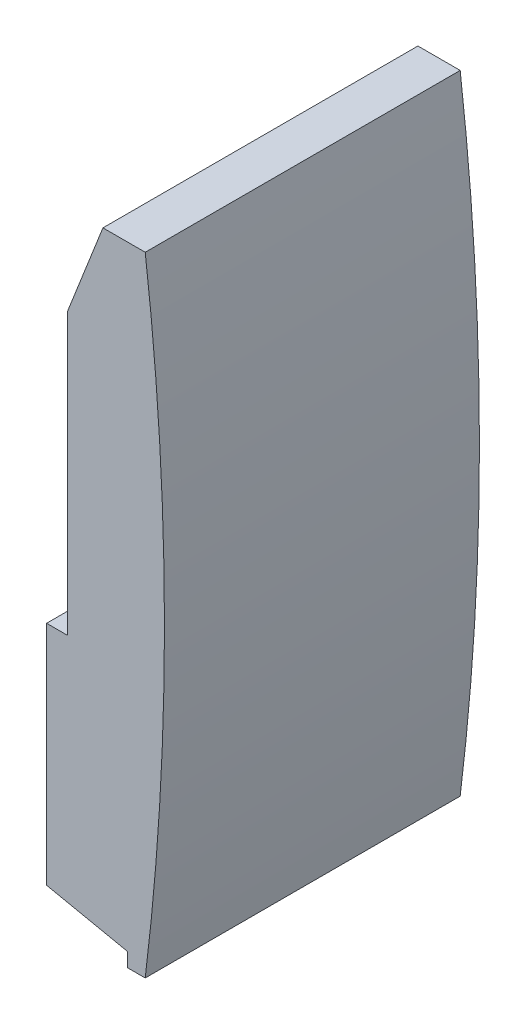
from build123d import *

# Parameters (mm, degrees)
BOSS_EXTRU_1_DEPTH = 22.35


with BuildPart() as part:
    # Esquisse1 → Boss.-Extru.1 (new, symmetric)
    with BuildSketch(Plane.XY):
        with BuildLine():
            Line((349, -40.2), (360.5, -42.6))
            Line((360.5, -42.6), (360.5, -44.6))
            Line((360.5, -44.6), (363, -44.6))
            ThreePointArc((363, -44.6), (365.72962691, 0), (363, 44.6))
            Line((363, 44.6), (357, 44.6))
            Line((357, 44.6), (352, 31.9))
            Line((352, 31.9), (352, -8))
            Line((352, -8), (349, -8))
            Line((349, -8), (349, -40.2))
        make_face()
    extrude(amount=BOSS_EXTRU_1_DEPTH, both=True)


solid = part.part
